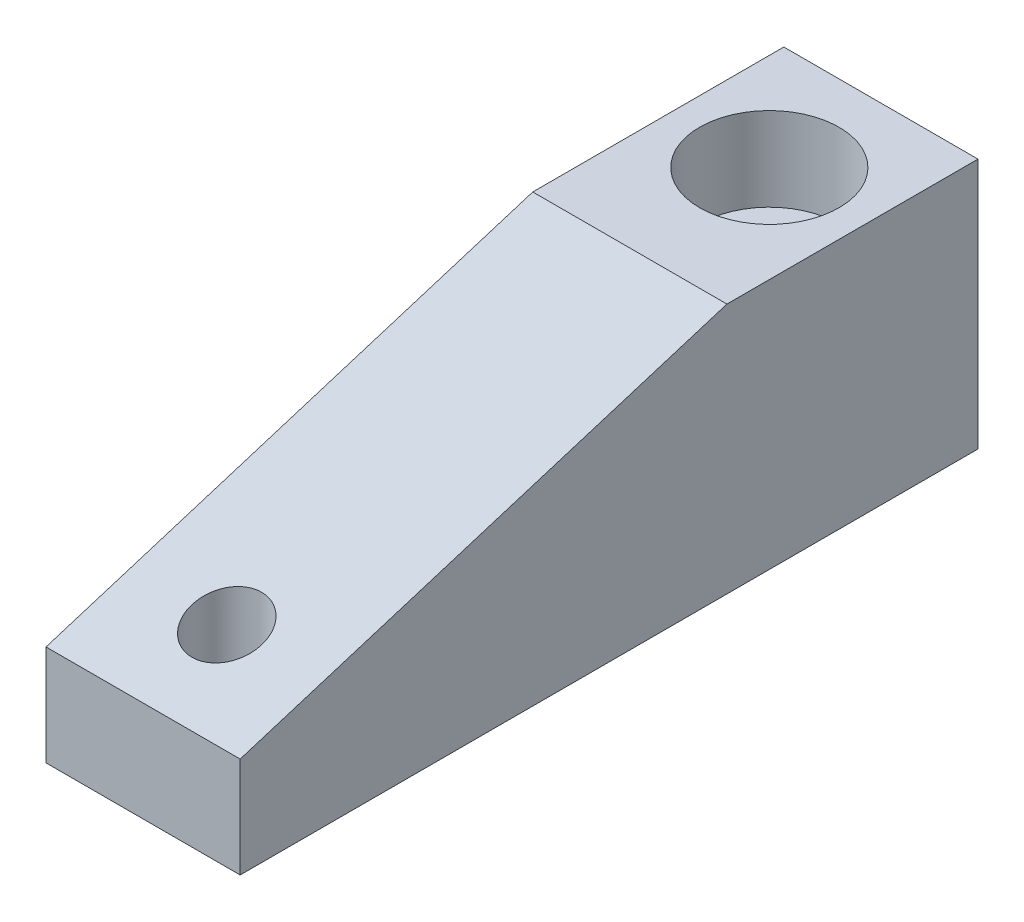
from build123d import *

# Parameters (mm, degrees)
SKETCH1_W          = 22.098
SKETCH1_H          = 83.9724
EXTRUDE1_DEPTH     = 28.575
FILLET1_R          = 0.381
CUT_EXTRUDE1_DEPTH = 92.412341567
SKETCH5_R          = 3.9624
CUT_EXTRUDE2_DEPTH = 92.412341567


with BuildPart() as part:
    # Sketch1 → Extrude1 (new body)
    with BuildSketch(Plane(origin=(0, 0, 0), x_dir=(1, 0, 0), z_dir=(0, 1, 0))):
        with Locations((11.049, -41.9862)):
            Rectangle(SKETCH1_W, SKETCH1_H)
    extrude(amount=EXTRUDE1_DEPTH)

    # Sketch3 → Cut-Revolve1 (revolve, cut)
    with BuildSketch(Plane(origin=(11.049, 0, 0), x_dir=(0, 0, -1), z_dir=(1, 0, 0))):
        Polygon((-20.6375, 28.575), (-20.6375, 19.05), (-17.653, 19.05), (-17.653, 13.4874), (-21.775741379, 13.4874), (-22.1996, 0), (-12.7, 0), (-12.7, 28.575), align=None)
    revolve(axis=Axis((11.049, 31.679444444, 12.7), (0, -1, 0)), mode=Mode.SUBTRACT)

    # Fillet1
    fillet1_edges = [part.edges().sort_by_distance(p)[0] for p in [
        (11.049, 13.4874, 3.624258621),
    ]]
    fillet(fillet1_edges, radius=FILLET1_R)

    # Sketch4 → Cut-Extrude1 (cut, through all)
    with BuildSketch(Plane(origin=(22.098, 0, 0), x_dir=(0, 0, -1), z_dir=(1, 0, 0))):
        Polygon((-83.9724, 11.43), (-83.9724, 28.575), (-28.575, 28.575), align=None)
    extrude(amount=-CUT_EXTRUDE1_DEPTH, mode=Mode.SUBTRACT)

    # Sketch5 → Cut-Extrude2 (cut, through all)
    with BuildSketch(Plane.XZ):
        with Locations(Location((11.049, 74.4474, 0), (0, 0, 270))):
            Circle(SKETCH5_R)
    extrude(amount=-CUT_EXTRUDE2_DEPTH, mode=Mode.SUBTRACT)


solid = part.part
